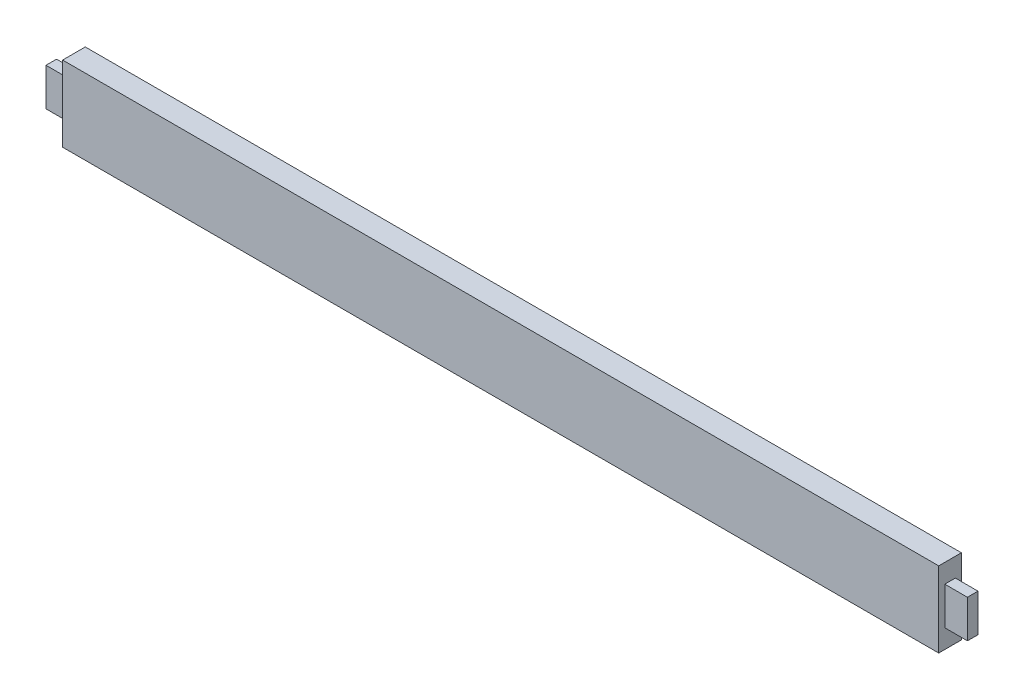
ISO-10303-21;
HEADER;
FILE_DESCRIPTION(('STEP AP214'),'2;1');
FILE_NAME('part.step','',(''),(''),'','','');
FILE_SCHEMA(('AUTOMOTIVE_DESIGN { 1 0 10303 214 1 1 1 1 }'));
ENDSEC;
DATA;
#1=APPLICATION_CONTEXT('core data for automotive mechanical design processes');
#2=APPLICATION_PROTOCOL_DEFINITION('international standard','automotive_design',2000,#1);
#3=PRODUCT_CONTEXT('',#1,'mechanical');
#4=PRODUCT('Part','Part','',(#3));
#5=PRODUCT_RELATED_PRODUCT_CATEGORY('part','',(#4));
#6=PRODUCT_DEFINITION_FORMATION('','',#4);
#7=PRODUCT_DEFINITION_CONTEXT('part definition',#1,'design');
#8=PRODUCT_DEFINITION('design','',#6,#7);
#9=PRODUCT_DEFINITION_SHAPE('','',#8);
#10=(LENGTH_UNIT() NAMED_UNIT(*) SI_UNIT(.MILLI.,.METRE.));
#11=(NAMED_UNIT(*) PLANE_ANGLE_UNIT() SI_UNIT($,.RADIAN.));
#12=(NAMED_UNIT(*) SI_UNIT($,.STERADIAN.) SOLID_ANGLE_UNIT());
#13=UNCERTAINTY_MEASURE_WITH_UNIT(LENGTH_MEASURE(1.E-05),#10,'distance_accuracy_value','');
#14=(GEOMETRIC_REPRESENTATION_CONTEXT(3) GLOBAL_UNCERTAINTY_ASSIGNED_CONTEXT((#13)) GLOBAL_UNIT_ASSIGNED_CONTEXT((#10,
#11,#12)) REPRESENTATION_CONTEXT('',''));
#15=CARTESIAN_POINT('',(0.,0.,0.));
#16=DIRECTION('',(0.,0.,1.));
#17=DIRECTION('',(1.,0.,0.));
#18=AXIS2_PLACEMENT_3D('',#15,#16,#17);
#19=CARTESIAN_POINT('',(580.,0.,0.));
#20=DIRECTION('',(-1.,0.,0.));
#21=DIRECTION('',(0.,0.,1.));
#22=AXIS2_PLACEMENT_3D('',#19,#20,#21);
#23=PLANE('',#22);
#24=DIRECTION('',(0.,-1.,0.));
#25=VECTOR('',#24,1.);
#26=CARTESIAN_POINT('',(580.,0.,0.));
#27=LINE('',#26,#25);
#28=CARTESIAN_POINT('',(580.,50.,0.));
#29=VERTEX_POINT('',#28);
#30=CARTESIAN_POINT('',(580.,0.,0.));
#31=VERTEX_POINT('',#30);
#32=EDGE_CURVE('E195',#29,#31,#27,.T.);
#33=ORIENTED_EDGE('',*,*,#32,.T.);
#34=DIRECTION('',(0.,0.,-1.));
#35=VECTOR('',#34,1.);
#36=CARTESIAN_POINT('',(580.,0.,0.));
#37=LINE('',#36,#35);
#38=CARTESIAN_POINT('',(580.,0.,-15.));
#39=VERTEX_POINT('',#38);
#40=EDGE_CURVE('E198',#31,#39,#37,.T.);
#41=ORIENTED_EDGE('',*,*,#40,.T.);
#42=DIRECTION('',(0.,1.,0.));
#43=VECTOR('',#42,1.);
#44=CARTESIAN_POINT('',(580.,0.,-15.));
#45=LINE('',#44,#43);
#46=CARTESIAN_POINT('',(580.,50.,-15.));
#47=VERTEX_POINT('',#46);
#48=EDGE_CURVE('E201',#39,#47,#45,.T.);
#49=ORIENTED_EDGE('',*,*,#48,.T.);
#50=DIRECTION('',(0.,0.,1.));
#51=VECTOR('',#50,1.);
#52=CARTESIAN_POINT('',(580.,50.,0.));
#53=LINE('',#52,#51);
#54=EDGE_CURVE('E203',#47,#29,#53,.T.);
#55=ORIENTED_EDGE('',*,*,#54,.T.);
#56=EDGE_LOOP('',(#33,#41,#49,#55));
#57=FACE_BOUND('',#56,.T.);
#58=DIRECTION('',(0.,1.,0.));
#59=VECTOR('',#58,1.);
#60=CARTESIAN_POINT('',(580.,0.,-11.));
#61=LINE('',#60,#59);
#62=CARTESIAN_POINT('',(580.,12.5,-11.));
#63=VERTEX_POINT('',#62);
#64=CARTESIAN_POINT('',(580.,37.5,-11.));
#65=VERTEX_POINT('',#64);
#66=EDGE_CURVE('E62',#63,#65,#61,.T.);
#67=ORIENTED_EDGE('',*,*,#66,.F.);
#68=DIRECTION('',(0.,0.,-1.));
#69=VECTOR('',#68,1.);
#70=CARTESIAN_POINT('',(580.,12.5,0.));
#71=LINE('',#70,#69);
#72=CARTESIAN_POINT('',(580.,12.5,-3.99999999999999));
#73=VERTEX_POINT('',#72);
#74=EDGE_CURVE('E66',#73,#63,#71,.T.);
#75=ORIENTED_EDGE('',*,*,#74,.F.);
#76=DIRECTION('',(0.,-1.,0.));
#77=VECTOR('',#76,1.);
#78=CARTESIAN_POINT('',(580.,0.,-4.));
#79=LINE('',#78,#77);
#80=CARTESIAN_POINT('',(580.,37.5,-3.99999999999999));
#81=VERTEX_POINT('',#80);
#82=EDGE_CURVE('E453',#81,#73,#79,.T.);
#83=ORIENTED_EDGE('',*,*,#82,.F.);
#84=DIRECTION('',(0.,0.,1.));
#85=VECTOR('',#84,1.);
#86=CARTESIAN_POINT('',(580.,37.5,0.));
#87=LINE('',#86,#85);
#88=EDGE_CURVE('E459',#65,#81,#87,.T.);
#89=ORIENTED_EDGE('',*,*,#88,.F.);
#90=EDGE_LOOP('',(#67,#75,#83,#89));
#91=FACE_BOUND('',#90,.T.);
#92=ADVANCED_FACE('F47',(#57,#91),#23,.F.);
#93=CARTESIAN_POINT('',(0.,0.,0.));
#94=DIRECTION('',(-1.,0.,0.));
#95=DIRECTION('',(0.,0.,1.));
#96=AXIS2_PLACEMENT_3D('',#93,#94,#95);
#97=PLANE('',#96);
#98=DIRECTION('',(0.,-1.,0.));
#99=VECTOR('',#98,1.);
#100=CARTESIAN_POINT('',(0.,0.,0.));
#101=LINE('',#100,#99);
#102=CARTESIAN_POINT('',(0.,50.,0.));
#103=VERTEX_POINT('',#102);
#104=CARTESIAN_POINT('',(0.,0.,0.));
#105=VERTEX_POINT('',#104);
#106=EDGE_CURVE('E189',#103,#105,#101,.T.);
#107=ORIENTED_EDGE('',*,*,#106,.F.);
#108=DIRECTION('',(0.,0.,1.));
#109=VECTOR('',#108,1.);
#110=CARTESIAN_POINT('',(0.,50.,0.));
#111=LINE('',#110,#109);
#112=CARTESIAN_POINT('',(0.,50.,-15.));
#113=VERTEX_POINT('',#112);
#114=EDGE_CURVE('E199',#113,#103,#111,.T.);
#115=ORIENTED_EDGE('',*,*,#114,.F.);
#116=DIRECTION('',(0.,1.,0.));
#117=VECTOR('',#116,1.);
#118=CARTESIAN_POINT('',(0.,0.,-15.));
#119=LINE('',#118,#117);
#120=CARTESIAN_POINT('',(0.,0.,-15.));
#121=VERTEX_POINT('',#120);
#122=EDGE_CURVE('E210',#121,#113,#119,.T.);
#123=ORIENTED_EDGE('',*,*,#122,.F.);
#124=DIRECTION('',(0.,0.,-1.));
#125=VECTOR('',#124,1.);
#126=CARTESIAN_POINT('',(0.,0.,0.));
#127=LINE('',#126,#125);
#128=EDGE_CURVE('E208',#105,#121,#127,.T.);
#129=ORIENTED_EDGE('',*,*,#128,.F.);
#130=EDGE_LOOP('',(#107,#115,#123,#129));
#131=FACE_BOUND('',#130,.T.);
#132=DIRECTION('',(0.,0.,-1.));
#133=VECTOR('',#132,1.);
#134=CARTESIAN_POINT('',(0.,12.5,-3.99999999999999));
#135=LINE('',#134,#133);
#136=CARTESIAN_POINT('',(0.,12.5,-3.99999999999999));
#137=VERTEX_POINT('',#136);
#138=CARTESIAN_POINT('',(0.,12.5,-11.));
#139=VERTEX_POINT('',#138);
#140=EDGE_CURVE('E169',#137,#139,#135,.T.);
#141=ORIENTED_EDGE('',*,*,#140,.T.);
#142=DIRECTION('',(0.,1.,0.));
#143=VECTOR('',#142,1.);
#144=CARTESIAN_POINT('',(0.,37.5,-11.));
#145=LINE('',#144,#143);
#146=CARTESIAN_POINT('',(0.,37.5,-11.));
#147=VERTEX_POINT('',#146);
#148=EDGE_CURVE('E156',#139,#147,#145,.T.);
#149=ORIENTED_EDGE('',*,*,#148,.T.);
#150=DIRECTION('',(0.,0.,1.));
#151=VECTOR('',#150,1.);
#152=CARTESIAN_POINT('',(0.,37.5,-3.99999999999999));
#153=LINE('',#152,#151);
#154=CARTESIAN_POINT('',(0.,37.5,-3.99999999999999));
#155=VERTEX_POINT('',#154);
#156=EDGE_CURVE('E159',#147,#155,#153,.T.);
#157=ORIENTED_EDGE('',*,*,#156,.T.);
#158=DIRECTION('',(0.,-1.,0.));
#159=VECTOR('',#158,1.);
#160=CARTESIAN_POINT('',(0.,37.5,-3.99999999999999));
#161=LINE('',#160,#159);
#162=EDGE_CURVE('E181',#155,#137,#161,.T.);
#163=ORIENTED_EDGE('',*,*,#162,.T.);
#164=EDGE_LOOP('',(#141,#149,#157,#163));
#165=FACE_BOUND('',#164,.T.);
#166=ADVANCED_FACE('F228',(#131,#165),#97,.T.);
#167=CARTESIAN_POINT('',(580.,0.,0.));
#168=DIRECTION('',(0.,0.,-1.));
#169=DIRECTION('',(0.,1.,0.));
#170=AXIS2_PLACEMENT_3D('',#167,#168,#169);
#171=PLANE('',#170);
#172=ORIENTED_EDGE('',*,*,#106,.T.);
#173=DIRECTION('',(-1.,0.,0.));
#174=VECTOR('',#173,1.);
#175=CARTESIAN_POINT('',(580.,0.,0.));
#176=LINE('',#175,#174);
#177=EDGE_CURVE('E11',#31,#105,#176,.T.);
#178=ORIENTED_EDGE('',*,*,#177,.F.);
#179=ORIENTED_EDGE('',*,*,#32,.F.);
#180=DIRECTION('',(-1.,0.,0.));
#181=VECTOR('',#180,1.);
#182=CARTESIAN_POINT('',(580.,50.,0.));
#183=LINE('',#182,#181);
#184=EDGE_CURVE('E205',#29,#103,#183,.T.);
#185=ORIENTED_EDGE('',*,*,#184,.T.);
#186=EDGE_LOOP('',(#172,#178,#179,#185));
#187=FACE_BOUND('',#186,.T.);
#188=ADVANCED_FACE('F49',(#187),#171,.F.);
#189=CARTESIAN_POINT('',(580.,0.,0.));
#190=DIRECTION('',(0.,1.,0.));
#191=DIRECTION('',(0.,0.,1.));
#192=AXIS2_PLACEMENT_3D('',#189,#190,#191);
#193=PLANE('',#192);
#194=ORIENTED_EDGE('',*,*,#128,.T.);
#195=DIRECTION('',(-1.,0.,0.));
#196=VECTOR('',#195,1.);
#197=CARTESIAN_POINT('',(580.,0.,-15.));
#198=LINE('',#197,#196);
#199=EDGE_CURVE('E55',#39,#121,#198,.T.);
#200=ORIENTED_EDGE('',*,*,#199,.F.);
#201=ORIENTED_EDGE('',*,*,#40,.F.);
#202=ORIENTED_EDGE('',*,*,#177,.T.);
#203=EDGE_LOOP('',(#194,#200,#201,#202));
#204=FACE_BOUND('',#203,.T.);
#205=ADVANCED_FACE('F238',(#204),#193,.F.);
#206=CARTESIAN_POINT('',(580.,0.,-15.));
#207=DIRECTION('',(0.,0.,1.));
#208=DIRECTION('',(0.,-1.,0.));
#209=AXIS2_PLACEMENT_3D('',#206,#207,#208);
#210=PLANE('',#209);
#211=ORIENTED_EDGE('',*,*,#122,.T.);
#212=DIRECTION('',(-1.,0.,0.));
#213=VECTOR('',#212,1.);
#214=CARTESIAN_POINT('',(580.,50.,-15.));
#215=LINE('',#214,#213);
#216=EDGE_CURVE('E215',#47,#113,#215,.T.);
#217=ORIENTED_EDGE('',*,*,#216,.F.);
#218=ORIENTED_EDGE('',*,*,#48,.F.);
#219=ORIENTED_EDGE('',*,*,#199,.T.);
#220=EDGE_LOOP('',(#211,#217,#218,#219));
#221=FACE_BOUND('',#220,.T.);
#222=ADVANCED_FACE('F222',(#221),#210,.F.);
#223=CARTESIAN_POINT('',(580.,50.,0.));
#224=DIRECTION('',(0.,-1.,0.));
#225=DIRECTION('',(0.,0.,-1.));
#226=AXIS2_PLACEMENT_3D('',#223,#224,#225);
#227=PLANE('',#226);
#228=ORIENTED_EDGE('',*,*,#114,.T.);
#229=ORIENTED_EDGE('',*,*,#184,.F.);
#230=ORIENTED_EDGE('',*,*,#54,.F.);
#231=ORIENTED_EDGE('',*,*,#216,.T.);
#232=EDGE_LOOP('',(#228,#229,#230,#231));
#233=FACE_BOUND('',#232,.T.);
#234=ADVANCED_FACE('F232',(#233),#227,.F.);
#235=CARTESIAN_POINT('',(-15.,37.5,-11.));
#236=DIRECTION('',(0.,0.,-1.));
#237=DIRECTION('',(0.,1.,0.));
#238=AXIS2_PLACEMENT_3D('',#235,#236,#237);
#239=PLANE('',#238);
#240=ORIENTED_EDGE('',*,*,#148,.F.);
#241=DIRECTION('',(1.,0.,0.));
#242=VECTOR('',#241,1.);
#243=CARTESIAN_POINT('',(-15.,12.5,-11.));
#244=LINE('',#243,#242);
#245=CARTESIAN_POINT('',(-15.,12.5,-11.));
#246=VERTEX_POINT('',#245);
#247=EDGE_CURVE('E186',#246,#139,#244,.T.);
#248=ORIENTED_EDGE('',*,*,#247,.F.);
#249=DIRECTION('',(0.,1.,0.));
#250=VECTOR('',#249,1.);
#251=CARTESIAN_POINT('',(-15.,37.5,-11.));
#252=LINE('',#251,#250);
#253=CARTESIAN_POINT('',(-15.,37.5,-11.));
#254=VERTEX_POINT('',#253);
#255=EDGE_CURVE('E165',#246,#254,#252,.T.);
#256=ORIENTED_EDGE('',*,*,#255,.T.);
#257=DIRECTION('',(1.,0.,0.));
#258=VECTOR('',#257,1.);
#259=CARTESIAN_POINT('',(-15.,37.5,-11.));
#260=LINE('',#259,#258);
#261=EDGE_CURVE('E177',#254,#147,#260,.T.);
#262=ORIENTED_EDGE('',*,*,#261,.T.);
#263=EDGE_LOOP('',(#240,#248,#256,#262));
#264=FACE_BOUND('',#263,.T.);
#265=ADVANCED_FACE('F252',(#264),#239,.T.);
#266=CARTESIAN_POINT('',(-15.,12.5,-3.99999999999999));
#267=DIRECTION('',(0.,-1.,0.));
#268=DIRECTION('',(0.,0.,-1.));
#269=AXIS2_PLACEMENT_3D('',#266,#267,#268);
#270=PLANE('',#269);
#271=ORIENTED_EDGE('',*,*,#140,.F.);
#272=DIRECTION('',(1.,0.,0.));
#273=VECTOR('',#272,1.);
#274=CARTESIAN_POINT('',(-15.,12.5,-3.99999999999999));
#275=LINE('',#274,#273);
#276=CARTESIAN_POINT('',(-15.,12.5,-3.99999999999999));
#277=VERTEX_POINT('',#276);
#278=EDGE_CURVE('E190',#277,#137,#275,.T.);
#279=ORIENTED_EDGE('',*,*,#278,.F.);
#280=DIRECTION('',(0.,0.,-1.));
#281=VECTOR('',#280,1.);
#282=CARTESIAN_POINT('',(-15.,12.5,-3.99999999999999));
#283=LINE('',#282,#281);
#284=EDGE_CURVE('E175',#277,#246,#283,.T.);
#285=ORIENTED_EDGE('',*,*,#284,.T.);
#286=ORIENTED_EDGE('',*,*,#247,.T.);
#287=EDGE_LOOP('',(#271,#279,#285,#286));
#288=FACE_BOUND('',#287,.T.);
#289=ADVANCED_FACE('F259',(#288),#270,.T.);
#290=CARTESIAN_POINT('',(-15.,37.5,-3.99999999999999));
#291=DIRECTION('',(0.,0.,1.));
#292=DIRECTION('',(0.,-1.,0.));
#293=AXIS2_PLACEMENT_3D('',#290,#291,#292);
#294=PLANE('',#293);
#295=ORIENTED_EDGE('',*,*,#162,.F.);
#296=DIRECTION('',(1.,0.,0.));
#297=VECTOR('',#296,1.);
#298=CARTESIAN_POINT('',(-15.,37.5,-3.99999999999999));
#299=LINE('',#298,#297);
#300=CARTESIAN_POINT('',(-15.,37.5,-3.99999999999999));
#301=VERTEX_POINT('',#300);
#302=EDGE_CURVE('E192',#301,#155,#299,.T.);
#303=ORIENTED_EDGE('',*,*,#302,.F.);
#304=DIRECTION('',(0.,-1.,0.));
#305=VECTOR('',#304,1.);
#306=CARTESIAN_POINT('',(-15.,37.5,-3.99999999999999));
#307=LINE('',#306,#305);
#308=EDGE_CURVE('E172',#301,#277,#307,.T.);
#309=ORIENTED_EDGE('',*,*,#308,.T.);
#310=ORIENTED_EDGE('',*,*,#278,.T.);
#311=EDGE_LOOP('',(#295,#303,#309,#310));
#312=FACE_BOUND('',#311,.T.);
#313=ADVANCED_FACE('F264',(#312),#294,.T.);
#314=CARTESIAN_POINT('',(-15.,37.5,-3.99999999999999));
#315=DIRECTION('',(0.,1.,0.));
#316=DIRECTION('',(0.,0.,1.));
#317=AXIS2_PLACEMENT_3D('',#314,#315,#316);
#318=PLANE('',#317);
#319=ORIENTED_EDGE('',*,*,#156,.F.);
#320=ORIENTED_EDGE('',*,*,#261,.F.);
#321=DIRECTION('',(0.,0.,1.));
#322=VECTOR('',#321,1.);
#323=CARTESIAN_POINT('',(-15.,37.5,-3.99999999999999));
#324=LINE('',#323,#322);
#325=EDGE_CURVE('E168',#254,#301,#324,.T.);
#326=ORIENTED_EDGE('',*,*,#325,.T.);
#327=ORIENTED_EDGE('',*,*,#302,.T.);
#328=EDGE_LOOP('',(#319,#320,#326,#327));
#329=FACE_BOUND('',#328,.T.);
#330=ADVANCED_FACE('F278',(#329),#318,.T.);
#331=CARTESIAN_POINT('',(-15.,0.,0.));
#332=DIRECTION('',(1.,0.,0.));
#333=DIRECTION('',(0.,0.,-1.));
#334=AXIS2_PLACEMENT_3D('',#331,#332,#333);
#335=PLANE('',#334);
#336=ORIENTED_EDGE('',*,*,#255,.F.);
#337=ORIENTED_EDGE('',*,*,#284,.F.);
#338=ORIENTED_EDGE('',*,*,#308,.F.);
#339=ORIENTED_EDGE('',*,*,#325,.F.);
#340=EDGE_LOOP('',(#336,#337,#338,#339));
#341=FACE_BOUND('',#340,.T.);
#342=ADVANCED_FACE('F276',(#341),#335,.F.);
#343=CARTESIAN_POINT('',(595.,0.,-11.));
#344=DIRECTION('',(0.,0.,1.));
#345=DIRECTION('',(0.,-1.,0.));
#346=AXIS2_PLACEMENT_3D('',#343,#344,#345);
#347=PLANE('',#346);
#348=ORIENTED_EDGE('',*,*,#66,.T.);
#349=DIRECTION('',(-1.,0.,0.));
#350=VECTOR('',#349,1.);
#351=CARTESIAN_POINT('',(595.,37.5,-11.));
#352=LINE('',#351,#350);
#353=CARTESIAN_POINT('',(595.,37.5,-11.));
#354=VERTEX_POINT('',#353);
#355=EDGE_CURVE('E139',#354,#65,#352,.T.);
#356=ORIENTED_EDGE('',*,*,#355,.F.);
#357=DIRECTION('',(0.,1.,0.));
#358=VECTOR('',#357,1.);
#359=CARTESIAN_POINT('',(595.,0.,-11.));
#360=LINE('',#359,#358);
#361=CARTESIAN_POINT('',(595.,12.5,-11.));
#362=VERTEX_POINT('',#361);
#363=EDGE_CURVE('E145',#362,#354,#360,.T.);
#364=ORIENTED_EDGE('',*,*,#363,.F.);
#365=DIRECTION('',(-1.,0.,0.));
#366=VECTOR('',#365,1.);
#367=CARTESIAN_POINT('',(595.,12.5,-11.));
#368=LINE('',#367,#366);
#369=EDGE_CURVE('E451',#362,#63,#368,.T.);
#370=ORIENTED_EDGE('',*,*,#369,.T.);
#371=EDGE_LOOP('',(#348,#356,#364,#370));
#372=FACE_BOUND('',#371,.T.);
#373=ADVANCED_FACE('F155',(#372),#347,.F.);
#374=CARTESIAN_POINT('',(595.,37.5,0.));
#375=DIRECTION('',(0.,-1.,0.));
#376=DIRECTION('',(0.,0.,-1.));
#377=AXIS2_PLACEMENT_3D('',#374,#375,#376);
#378=PLANE('',#377);
#379=ORIENTED_EDGE('',*,*,#88,.T.);
#380=DIRECTION('',(-1.,0.,0.));
#381=VECTOR('',#380,1.);
#382=CARTESIAN_POINT('',(595.,37.5,-3.99999999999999));
#383=LINE('',#382,#381);
#384=CARTESIAN_POINT('',(595.,37.5,-3.99999999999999));
#385=VERTEX_POINT('',#384);
#386=EDGE_CURVE('E141',#385,#81,#383,.T.);
#387=ORIENTED_EDGE('',*,*,#386,.F.);
#388=DIRECTION('',(0.,0.,1.));
#389=VECTOR('',#388,1.);
#390=CARTESIAN_POINT('',(595.,37.5,0.));
#391=LINE('',#390,#389);
#392=EDGE_CURVE('E134',#354,#385,#391,.T.);
#393=ORIENTED_EDGE('',*,*,#392,.F.);
#394=ORIENTED_EDGE('',*,*,#355,.T.);
#395=EDGE_LOOP('',(#379,#387,#393,#394));
#396=FACE_BOUND('',#395,.T.);
#397=ADVANCED_FACE('F137',(#396),#378,.F.);
#398=CARTESIAN_POINT('',(595.,0.,-4.));
#399=DIRECTION('',(0.,0.,-1.));
#400=DIRECTION('',(0.,1.,0.));
#401=AXIS2_PLACEMENT_3D('',#398,#399,#400);
#402=PLANE('',#401);
#403=ORIENTED_EDGE('',*,*,#82,.T.);
#404=DIRECTION('',(-1.,0.,0.));
#405=VECTOR('',#404,1.);
#406=CARTESIAN_POINT('',(595.,12.5,-3.99999999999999));
#407=LINE('',#406,#405);
#408=CARTESIAN_POINT('',(595.,12.5,-3.99999999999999));
#409=VERTEX_POINT('',#408);
#410=EDGE_CURVE('E161',#409,#73,#407,.T.);
#411=ORIENTED_EDGE('',*,*,#410,.F.);
#412=DIRECTION('',(0.,-1.,0.));
#413=VECTOR('',#412,1.);
#414=CARTESIAN_POINT('',(595.,0.,-4.));
#415=LINE('',#414,#413);
#416=EDGE_CURVE('E144',#385,#409,#415,.T.);
#417=ORIENTED_EDGE('',*,*,#416,.F.);
#418=ORIENTED_EDGE('',*,*,#386,.T.);
#419=EDGE_LOOP('',(#403,#411,#417,#418));
#420=FACE_BOUND('',#419,.T.);
#421=ADVANCED_FACE('F291',(#420),#402,.F.);
#422=CARTESIAN_POINT('',(595.,12.5,0.));
#423=DIRECTION('',(0.,1.,0.));
#424=DIRECTION('',(0.,0.,1.));
#425=AXIS2_PLACEMENT_3D('',#422,#423,#424);
#426=PLANE('',#425);
#427=ORIENTED_EDGE('',*,*,#74,.T.);
#428=ORIENTED_EDGE('',*,*,#369,.F.);
#429=DIRECTION('',(0.,0.,-1.));
#430=VECTOR('',#429,1.);
#431=CARTESIAN_POINT('',(595.,12.5,0.));
#432=LINE('',#431,#430);
#433=EDGE_CURVE('E150',#409,#362,#432,.T.);
#434=ORIENTED_EDGE('',*,*,#433,.F.);
#435=ORIENTED_EDGE('',*,*,#410,.T.);
#436=EDGE_LOOP('',(#427,#428,#434,#435));
#437=FACE_BOUND('',#436,.T.);
#438=ADVANCED_FACE('F294',(#437),#426,.F.);
#439=CARTESIAN_POINT('',(595.,0.,0.));
#440=DIRECTION('',(1.,0.,0.));
#441=DIRECTION('',(0.,0.,-1.));
#442=AXIS2_PLACEMENT_3D('',#439,#440,#441);
#443=PLANE('',#442);
#444=ORIENTED_EDGE('',*,*,#363,.T.);
#445=ORIENTED_EDGE('',*,*,#392,.T.);
#446=ORIENTED_EDGE('',*,*,#416,.T.);
#447=ORIENTED_EDGE('',*,*,#433,.T.);
#448=EDGE_LOOP('',(#444,#445,#446,#447));
#449=FACE_BOUND('',#448,.T.);
#450=ADVANCED_FACE('F148',(#449),#443,.T.);
#451=CLOSED_SHELL('',(#92,#166,#188,#205,#222,#234,#265,#289,#313,#330,#342,#373,#397,#421,#438,#450));
#452=MANIFOLD_SOLID_BREP('B2',#451);
#453=ADVANCED_BREP_SHAPE_REPRESENTATION('',(#18,#452),#14);
#454=SHAPE_DEFINITION_REPRESENTATION(#9,#453);
ENDSEC;
END-ISO-10303-21;
